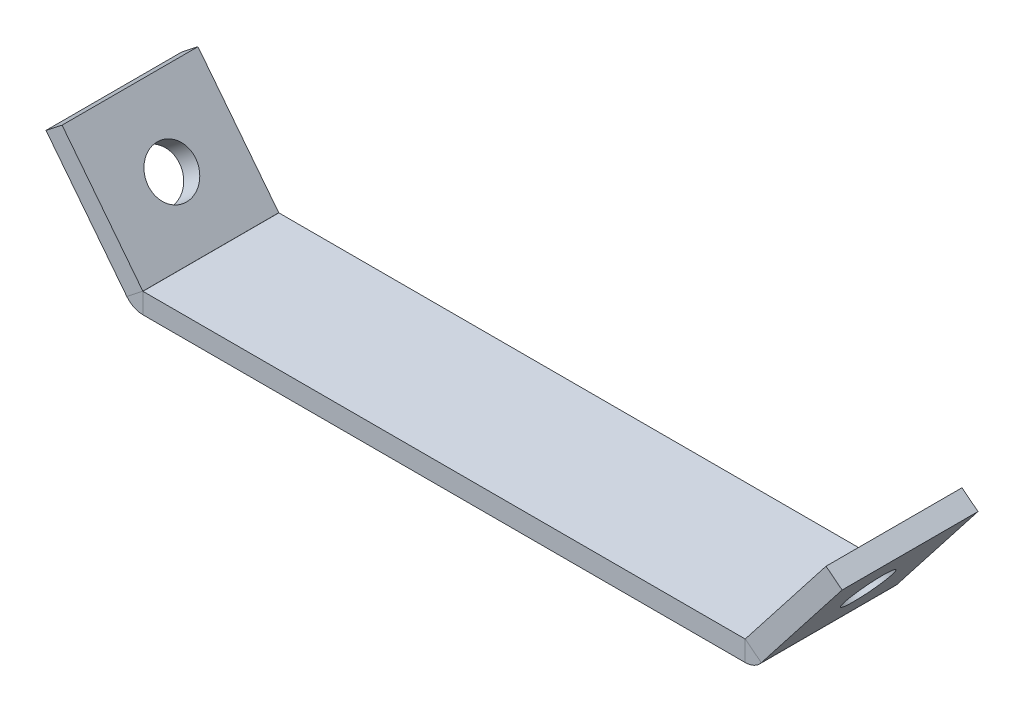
ISO-10303-21;
HEADER;
FILE_DESCRIPTION(('STEP AP214'),'2;1');
FILE_NAME('part.step','',(''),(''),'','','');
FILE_SCHEMA(('AUTOMOTIVE_DESIGN { 1 0 10303 214 1 1 1 1 }'));
ENDSEC;
DATA;
#1=APPLICATION_CONTEXT('core data for automotive mechanical design processes');
#2=APPLICATION_PROTOCOL_DEFINITION('international standard','automotive_design',2000,#1);
#3=PRODUCT_CONTEXT('',#1,'mechanical');
#4=PRODUCT('Part','Part','',(#3));
#5=PRODUCT_RELATED_PRODUCT_CATEGORY('part','',(#4));
#6=PRODUCT_DEFINITION_FORMATION('','',#4);
#7=PRODUCT_DEFINITION_CONTEXT('part definition',#1,'design');
#8=PRODUCT_DEFINITION('design','',#6,#7);
#9=PRODUCT_DEFINITION_SHAPE('','',#8);
#10=(LENGTH_UNIT() NAMED_UNIT(*) SI_UNIT(.MILLI.,.METRE.));
#11=(NAMED_UNIT(*) PLANE_ANGLE_UNIT() SI_UNIT($,.RADIAN.));
#12=(NAMED_UNIT(*) SI_UNIT($,.STERADIAN.) SOLID_ANGLE_UNIT());
#13=UNCERTAINTY_MEASURE_WITH_UNIT(LENGTH_MEASURE(1.E-05),#10,'distance_accuracy_value','');
#14=(GEOMETRIC_REPRESENTATION_CONTEXT(3) GLOBAL_UNCERTAINTY_ASSIGNED_CONTEXT((#13)) GLOBAL_UNIT_ASSIGNED_CONTEXT((#10,
#11,#12)) REPRESENTATION_CONTEXT('',''));
#15=CARTESIAN_POINT('',(0.,0.,0.));
#16=DIRECTION('',(0.,0.,1.));
#17=DIRECTION('',(1.,0.,0.));
#18=AXIS2_PLACEMENT_3D('',#15,#16,#17);
#19=CARTESIAN_POINT('',(0.,1.5,-10.));
#20=DIRECTION('',(0.,0.,1.));
#21=DIRECTION('',(1.,0.,0.));
#22=AXIS2_PLACEMENT_3D('',#19,#20,#21);
#23=PLANE('',#22);
#24=DIRECTION('',(-1.,0.,0.));
#25=VECTOR('',#24,1.);
#26=CARTESIAN_POINT('',(0.,1.5,-10.));
#27=LINE('',#26,#25);
#28=CARTESIAN_POINT('',(54.6551229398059,1.49999996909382,-10.));
#29=VERTEX_POINT('',#28);
#30=CARTESIAN_POINT('',(10.3448770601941,1.5,-10.));
#31=VERTEX_POINT('',#30);
#32=EDGE_CURVE('E236',#29,#31,#27,.T.);
#33=ORIENTED_EDGE('',*,*,#32,.F.);
#34=DIRECTION('',(0.,-1.,0.));
#35=VECTOR('',#34,1.);
#36=CARTESIAN_POINT('',(54.6551229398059,1.5,-10.));
#37=LINE('',#36,#35);
#38=CARTESIAN_POINT('',(54.6551229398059,0.,-10.));
#39=VERTEX_POINT('',#38);
#40=EDGE_CURVE('E12',#29,#39,#37,.T.);
#41=ORIENTED_EDGE('',*,*,#40,.T.);
#42=DIRECTION('',(-1.,0.,0.));
#43=VECTOR('',#42,1.);
#44=CARTESIAN_POINT('',(0.,0.,-10.));
#45=LINE('',#44,#43);
#46=CARTESIAN_POINT('',(10.3448770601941,0.,-10.));
#47=VERTEX_POINT('',#46);
#48=EDGE_CURVE('E251',#39,#47,#45,.T.);
#49=ORIENTED_EDGE('',*,*,#48,.T.);
#50=DIRECTION('',(0.,-1.,0.));
#51=VECTOR('',#50,1.);
#52=CARTESIAN_POINT('',(10.3448770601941,1.5,-10.));
#53=LINE('',#52,#51);
#54=EDGE_CURVE('E235',#31,#47,#53,.T.);
#55=ORIENTED_EDGE('',*,*,#54,.F.);
#56=EDGE_LOOP('',(#33,#41,#49,#55));
#57=FACE_BOUND('',#56,.T.);
#58=ADVANCED_FACE('F40',(#57),#23,.F.);
#59=CARTESIAN_POINT('',(0.,1.5,0.));
#60=DIRECTION('',(0.,0.,-1.));
#61=DIRECTION('',(-1.,0.,0.));
#62=AXIS2_PLACEMENT_3D('',#59,#60,#61);
#63=PLANE('',#62);
#64=DIRECTION('',(1.,0.,0.));
#65=VECTOR('',#64,1.);
#66=CARTESIAN_POINT('',(0.,0.,0.));
#67=LINE('',#66,#65);
#68=CARTESIAN_POINT('',(10.3448770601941,0.,0.));
#69=VERTEX_POINT('',#68);
#70=CARTESIAN_POINT('',(54.6551229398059,-3.82582060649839E-08,0.));
#71=VERTEX_POINT('',#70);
#72=EDGE_CURVE('E62',#69,#71,#67,.T.);
#73=ORIENTED_EDGE('',*,*,#72,.T.);
#74=DIRECTION('',(0.,1.,0.));
#75=VECTOR('',#74,1.);
#76=CARTESIAN_POINT('',(54.6551229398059,1.5,0.));
#77=LINE('',#76,#75);
#78=CARTESIAN_POINT('',(54.6551229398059,1.49999996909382,0.));
#79=VERTEX_POINT('',#78);
#80=EDGE_CURVE('E247',#71,#79,#77,.T.);
#81=ORIENTED_EDGE('',*,*,#80,.T.);
#82=DIRECTION('',(1.,0.,0.));
#83=VECTOR('',#82,1.);
#84=CARTESIAN_POINT('',(0.,1.5,0.));
#85=LINE('',#84,#83);
#86=CARTESIAN_POINT('',(10.3448770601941,1.50000000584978,0.));
#87=VERTEX_POINT('',#86);
#88=EDGE_CURVE('E43',#87,#79,#85,.T.);
#89=ORIENTED_EDGE('',*,*,#88,.F.);
#90=DIRECTION('',(0.,1.,0.));
#91=VECTOR('',#90,1.);
#92=CARTESIAN_POINT('',(10.3448770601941,1.5,0.));
#93=LINE('',#92,#91);
#94=EDGE_CURVE('E241',#69,#87,#93,.T.);
#95=ORIENTED_EDGE('',*,*,#94,.F.);
#96=EDGE_LOOP('',(#73,#81,#89,#95));
#97=FACE_BOUND('',#96,.T.);
#98=ADVANCED_FACE('F261',(#97),#63,.F.);
#99=CARTESIAN_POINT('',(0.,1.5,-10.));
#100=DIRECTION('',(0.,-1.,0.));
#101=DIRECTION('',(0.,0.,-1.));
#102=AXIS2_PLACEMENT_3D('',#99,#100,#101);
#103=PLANE('',#102);
#104=ORIENTED_EDGE('',*,*,#88,.T.);
#105=DIRECTION('',(0.,0.,-1.));
#106=VECTOR('',#105,1.);
#107=CARTESIAN_POINT('',(54.6551229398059,1.5,-10.));
#108=LINE('',#107,#106);
#109=EDGE_CURVE('E244',#79,#29,#108,.T.);
#110=ORIENTED_EDGE('',*,*,#109,.T.);
#111=ORIENTED_EDGE('',*,*,#32,.T.);
#112=DIRECTION('',(0.,0.,-1.));
#113=VECTOR('',#112,1.);
#114=CARTESIAN_POINT('',(10.3448770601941,1.5,-10.));
#115=LINE('',#114,#113);
#116=EDGE_CURVE('E232',#87,#31,#115,.T.);
#117=ORIENTED_EDGE('',*,*,#116,.F.);
#118=EDGE_LOOP('',(#104,#110,#111,#117));
#119=FACE_BOUND('',#118,.T.);
#120=ADVANCED_FACE('F258',(#119),#103,.F.);
#121=CARTESIAN_POINT('',(0.,0.,-10.));
#122=DIRECTION('',(0.,-1.,0.));
#123=DIRECTION('',(0.,0.,-1.));
#124=AXIS2_PLACEMENT_3D('',#121,#122,#123);
#125=PLANE('',#124);
#126=DIRECTION('',(0.,0.,-1.));
#127=VECTOR('',#126,1.);
#128=CARTESIAN_POINT('',(54.6551229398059,0.,-10.));
#129=LINE('',#128,#127);
#130=EDGE_CURVE('E48',#71,#39,#129,.T.);
#131=ORIENTED_EDGE('',*,*,#130,.F.);
#132=ORIENTED_EDGE('',*,*,#72,.F.);
#133=DIRECTION('',(0.,0.,-1.));
#134=VECTOR('',#133,1.);
#135=CARTESIAN_POINT('',(10.3448770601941,0.,-10.));
#136=LINE('',#135,#134);
#137=EDGE_CURVE('E239',#69,#47,#136,.T.);
#138=ORIENTED_EDGE('',*,*,#137,.T.);
#139=ORIENTED_EDGE('',*,*,#48,.F.);
#140=EDGE_LOOP('',(#131,#132,#138,#139));
#141=FACE_BOUND('',#140,.T.);
#142=ADVANCED_FACE('F311',(#141),#125,.T.);
#143=CARTESIAN_POINT('',(10.3448770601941,1.50999999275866,0.));
#144=DIRECTION('',(0.,0.,-1.));
#145=DIRECTION('',(-1.,0.,0.));
#146=AXIS2_PLACEMENT_3D('',#143,#144,#145);
#147=PLANE('',#146);
#148=DIRECTION('',(0.788010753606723,0.615661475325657,0.));
#149=VECTOR('',#148,1.);
#150=CARTESIAN_POINT('',(10.336996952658,1.50384338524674,0.));
#151=LINE('',#150,#149);
#152=CARTESIAN_POINT('',(9.15498082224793,0.580351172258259,0.));
#153=VERTEX_POINT('',#152);
#154=CARTESIAN_POINT('',(10.336996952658,1.50384338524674,0.));
#155=VERTEX_POINT('',#154);
#156=EDGE_CURVE('E187',#153,#155,#151,.T.);
#157=ORIENTED_EDGE('',*,*,#156,.F.);
#158=CARTESIAN_POINT('',(10.3448770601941,1.51,0.));
#159=DIRECTION('',(0.,0.,1.));
#160=DIRECTION('',(1.,0.,0.));
#161=AXIS2_PLACEMENT_3D('',#158,#159,#160);
#162=CIRCLE('',#161,1.50999999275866);
#163=EDGE_CURVE('E186',#153,#69,#162,.T.);
#164=ORIENTED_EDGE('',*,*,#163,.T.);
#165=ORIENTED_EDGE('',*,*,#94,.T.);
#166=CARTESIAN_POINT('',(10.3448770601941,1.50999999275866,0.));
#167=DIRECTION('',(0.,0.,1.));
#168=DIRECTION('',(1.,0.,0.));
#169=AXIS2_PLACEMENT_3D('',#166,#167,#168);
#170=CIRCLE('',#169,0.00999998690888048);
#171=EDGE_CURVE('E224',#155,#87,#170,.T.);
#172=ORIENTED_EDGE('',*,*,#171,.F.);
#173=EDGE_LOOP('',(#157,#164,#165,#172));
#174=FACE_BOUND('',#173,.T.);
#175=ADVANCED_FACE('F307',(#174),#147,.F.);
#176=CARTESIAN_POINT('',(10.3448770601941,1.50999999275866,-10.));
#177=DIRECTION('',(0.,0.,1.));
#178=DIRECTION('',(1.,0.,0.));
#179=AXIS2_PLACEMENT_3D('',#176,#177,#178);
#180=PLANE('',#179);
#181=ORIENTED_EDGE('',*,*,#54,.T.);
#182=CARTESIAN_POINT('',(10.3448770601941,1.51,-10.));
#183=DIRECTION('',(0.,0.,1.));
#184=DIRECTION('',(1.,0.,0.));
#185=AXIS2_PLACEMENT_3D('',#182,#183,#184);
#186=CIRCLE('',#185,1.50999999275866);
#187=CARTESIAN_POINT('',(9.15498082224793,0.580351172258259,-10.));
#188=VERTEX_POINT('',#187);
#189=EDGE_CURVE('E221',#47,#188,#186,.F.);
#190=ORIENTED_EDGE('',*,*,#189,.T.);
#191=DIRECTION('',(-0.788010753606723,-0.615661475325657,0.));
#192=VECTOR('',#191,1.);
#193=CARTESIAN_POINT('',(10.336996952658,1.50384338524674,-10.));
#194=LINE('',#193,#192);
#195=CARTESIAN_POINT('',(10.3369969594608,1.50384339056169,-10.));
#196=VERTEX_POINT('',#195);
#197=EDGE_CURVE('E197',#196,#188,#194,.T.);
#198=ORIENTED_EDGE('',*,*,#197,.F.);
#199=CARTESIAN_POINT('',(10.3448770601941,1.50999999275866,-10.));
#200=DIRECTION('',(0.,0.,-1.));
#201=DIRECTION('',(-1.,0.,0.));
#202=AXIS2_PLACEMENT_3D('',#199,#200,#201);
#203=CIRCLE('',#202,0.00999998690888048);
#204=EDGE_CURVE('E229',#31,#196,#203,.T.);
#205=ORIENTED_EDGE('',*,*,#204,.F.);
#206=EDGE_LOOP('',(#181,#190,#198,#205));
#207=FACE_BOUND('',#206,.T.);
#208=ADVANCED_FACE('F293',(#207),#180,.F.);
#209=CARTESIAN_POINT('',(10.3448770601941,1.51,-15.1353717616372));
#210=DIRECTION('',(0.,0.,1.));
#211=DIRECTION('',(1.,0.,0.));
#212=AXIS2_PLACEMENT_3D('',#209,#210,#211);
#213=CYLINDRICAL_SURFACE('',#212,0.00999999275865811);
#214=ORIENTED_EDGE('',*,*,#204,.T.);
#215=DIRECTION('',(0.,0.,-1.));
#216=VECTOR('',#215,1.);
#217=CARTESIAN_POINT('',(10.336996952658,1.50384338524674,-10.));
#218=LINE('',#217,#216);
#219=EDGE_CURVE('E205',#155,#196,#218,.T.);
#220=ORIENTED_EDGE('',*,*,#219,.F.);
#221=ORIENTED_EDGE('',*,*,#171,.T.);
#222=ORIENTED_EDGE('',*,*,#116,.T.);
#223=EDGE_LOOP('',(#214,#220,#221,#222));
#224=FACE_BOUND('',#223,.T.);
#225=ADVANCED_FACE('F289',(#224),#213,.F.);
#226=CARTESIAN_POINT('',(10.3448770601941,1.51,-15.1353717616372));
#227=DIRECTION('',(0.,0.,1.));
#228=DIRECTION('',(1.,0.,0.));
#229=AXIS2_PLACEMENT_3D('',#226,#227,#228);
#230=CYLINDRICAL_SURFACE('',#229,1.50999999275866);
#231=ORIENTED_EDGE('',*,*,#189,.F.);
#232=ORIENTED_EDGE('',*,*,#137,.F.);
#233=ORIENTED_EDGE('',*,*,#163,.F.);
#234=DIRECTION('',(0.,0.,-1.));
#235=VECTOR('',#234,1.);
#236=CARTESIAN_POINT('',(9.15498082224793,0.580351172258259,-10.));
#237=LINE('',#236,#235);
#238=EDGE_CURVE('E182',#153,#188,#237,.T.);
#239=ORIENTED_EDGE('',*,*,#238,.T.);
#240=EDGE_LOOP('',(#231,#232,#233,#239));
#241=FACE_BOUND('',#240,.T.);
#242=ADVANCED_FACE('F310',(#241),#230,.T.);
#243=CARTESIAN_POINT('',(4.39270971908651,9.11218408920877,0.));
#244=DIRECTION('',(0.615661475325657,-0.788010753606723,0.));
#245=DIRECTION('',(0.,0.,-1.));
#246=AXIS2_PLACEMENT_3D('',#243,#244,#245);
#247=PLANE('',#246);
#248=DIRECTION('',(0.,0.,1.));
#249=VECTOR('',#248,1.);
#250=CARTESIAN_POINT('',(3.21069358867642,8.18869187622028,0.));
#251=LINE('',#250,#249);
#252=CARTESIAN_POINT('',(3.21069358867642,8.18869187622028,-10.));
#253=VERTEX_POINT('',#252);
#254=CARTESIAN_POINT('',(3.21069358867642,8.18869187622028,0.));
#255=VERTEX_POINT('',#254);
#256=EDGE_CURVE('E216',#253,#255,#251,.T.);
#257=ORIENTED_EDGE('',*,*,#256,.T.);
#258=DIRECTION('',(-0.788010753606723,-0.615661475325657,0.));
#259=VECTOR('',#258,1.);
#260=CARTESIAN_POINT('',(4.39270971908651,9.11218408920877,0.));
#261=LINE('',#260,#259);
#262=CARTESIAN_POINT('',(4.39270971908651,9.11218408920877,0.));
#263=VERTEX_POINT('',#262);
#264=EDGE_CURVE('E183',#263,#255,#261,.T.);
#265=ORIENTED_EDGE('',*,*,#264,.F.);
#266=DIRECTION('',(0.,0.,1.));
#267=VECTOR('',#266,1.);
#268=CARTESIAN_POINT('',(4.39270971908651,9.11218408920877,0.));
#269=LINE('',#268,#267);
#270=CARTESIAN_POINT('',(4.39270971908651,9.11218408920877,-10.));
#271=VERTEX_POINT('',#270);
#272=EDGE_CURVE('E200',#271,#263,#269,.T.);
#273=ORIENTED_EDGE('',*,*,#272,.F.);
#274=DIRECTION('',(-0.788010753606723,-0.615661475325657,0.));
#275=VECTOR('',#274,1.);
#276=CARTESIAN_POINT('',(4.39270971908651,9.11218408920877,-10.));
#277=LINE('',#276,#275);
#278=EDGE_CURVE('E213',#271,#253,#277,.T.);
#279=ORIENTED_EDGE('',*,*,#278,.T.);
#280=EDGE_LOOP('',(#257,#265,#273,#279));
#281=FACE_BOUND('',#280,.T.);
#282=ADVANCED_FACE('F333',(#281),#247,.F.);
#283=CARTESIAN_POINT('',(7.47101709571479,5.17213032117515,-5.));
#284=DIRECTION('',(-0.788010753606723,-0.615661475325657,0.));
#285=DIRECTION('',(0.,0.,-1.));
#286=AXIS2_PLACEMENT_3D('',#283,#284,#285);
#287=CYLINDRICAL_SURFACE('',#286,1.75);
#288=CARTESIAN_POINT('',(7.47101709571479,5.17213032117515,-5.));
#289=DIRECTION('',(0.788010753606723,0.615661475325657,0.));
#290=DIRECTION('',(0.,0.,1.));
#291=AXIS2_PLACEMENT_3D('',#288,#289,#290);
#292=CIRCLE('',#291,1.75);
#293=CARTESIAN_POINT('',(7.47101709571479,5.17213032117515,-3.25));
#294=VERTEX_POINT('',#293);
#295=EDGE_CURVE('E210',#294,#294,#292,.T.);
#296=ORIENTED_EDGE('',*,*,#295,.T.);
#297=EDGE_LOOP('',(#296));
#298=FACE_BOUND('',#297,.T.);
#299=CARTESIAN_POINT('',(6.28900096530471,4.24863810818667,-5.));
#300=DIRECTION('',(0.788010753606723,0.615661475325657,0.));
#301=DIRECTION('',(0.,0.,1.));
#302=AXIS2_PLACEMENT_3D('',#299,#300,#301);
#303=CIRCLE('',#302,1.75);
#304=CARTESIAN_POINT('',(6.28900096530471,4.24863810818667,-3.25));
#305=VERTEX_POINT('',#304);
#306=EDGE_CURVE('E192',#305,#305,#303,.T.);
#307=ORIENTED_EDGE('',*,*,#306,.F.);
#308=EDGE_LOOP('',(#307));
#309=FACE_BOUND('',#308,.T.);
#310=ADVANCED_FACE('F344',(#298,#309),#287,.F.);
#311=CARTESIAN_POINT('',(4.39270971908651,9.11218408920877,-10.));
#312=DIRECTION('',(-0.788010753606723,-0.615661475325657,0.));
#313=DIRECTION('',(0.,0.,-1.));
#314=AXIS2_PLACEMENT_3D('',#311,#312,#313);
#315=PLANE('',#314);
#316=ORIENTED_EDGE('',*,*,#295,.F.);
#317=EDGE_LOOP('',(#316));
#318=FACE_BOUND('',#317,.T.);
#319=DIRECTION('',(0.615661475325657,-0.788010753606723,0.));
#320=VECTOR('',#319,1.);
#321=CARTESIAN_POINT('',(4.39270971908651,9.11218408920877,0.));
#322=LINE('',#321,#320);
#323=EDGE_CURVE('E208',#263,#155,#322,.T.);
#324=ORIENTED_EDGE('',*,*,#323,.T.);
#325=ORIENTED_EDGE('',*,*,#219,.T.);
#326=DIRECTION('',(-0.615661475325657,0.788010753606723,0.));
#327=VECTOR('',#326,1.);
#328=CARTESIAN_POINT('',(4.39270971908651,9.11218408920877,-10.));
#329=LINE('',#328,#327);
#330=EDGE_CURVE('E203',#196,#271,#329,.T.);
#331=ORIENTED_EDGE('',*,*,#330,.T.);
#332=ORIENTED_EDGE('',*,*,#272,.T.);
#333=EDGE_LOOP('',(#324,#325,#331,#332));
#334=FACE_BOUND('',#333,.T.);
#335=ADVANCED_FACE('F299',(#318,#334),#315,.F.);
#336=CARTESIAN_POINT('',(4.39270971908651,9.11218408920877,-10.));
#337=DIRECTION('',(0.,0.,1.));
#338=DIRECTION('',(0.615661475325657,-0.788010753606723,0.));
#339=AXIS2_PLACEMENT_3D('',#336,#337,#338);
#340=PLANE('',#339);
#341=ORIENTED_EDGE('',*,*,#330,.F.);
#342=ORIENTED_EDGE('',*,*,#197,.T.);
#343=DIRECTION('',(-0.615661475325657,0.788010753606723,0.));
#344=VECTOR('',#343,1.);
#345=CARTESIAN_POINT('',(3.21069358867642,8.18869187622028,-10.));
#346=LINE('',#345,#344);
#347=EDGE_CURVE('E195',#188,#253,#346,.T.);
#348=ORIENTED_EDGE('',*,*,#347,.T.);
#349=ORIENTED_EDGE('',*,*,#278,.F.);
#350=EDGE_LOOP('',(#341,#342,#348,#349));
#351=FACE_BOUND('',#350,.T.);
#352=ADVANCED_FACE('F295',(#351),#340,.F.);
#353=CARTESIAN_POINT('',(3.21069358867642,8.18869187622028,-10.));
#354=DIRECTION('',(-0.788010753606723,-0.615661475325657,0.));
#355=DIRECTION('',(0.,0.,-1.));
#356=AXIS2_PLACEMENT_3D('',#353,#354,#355);
#357=PLANE('',#356);
#358=ORIENTED_EDGE('',*,*,#238,.F.);
#359=DIRECTION('',(0.615661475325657,-0.788010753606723,0.));
#360=VECTOR('',#359,1.);
#361=CARTESIAN_POINT('',(3.21069358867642,8.18869187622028,0.));
#362=LINE('',#361,#360);
#363=EDGE_CURVE('E190',#255,#153,#362,.T.);
#364=ORIENTED_EDGE('',*,*,#363,.F.);
#365=ORIENTED_EDGE('',*,*,#256,.F.);
#366=ORIENTED_EDGE('',*,*,#347,.F.);
#367=EDGE_LOOP('',(#358,#364,#365,#366));
#368=FACE_BOUND('',#367,.T.);
#369=ORIENTED_EDGE('',*,*,#306,.T.);
#370=EDGE_LOOP('',(#369));
#371=FACE_BOUND('',#370,.T.);
#372=ADVANCED_FACE('F336',(#368,#371),#357,.T.);
#373=CARTESIAN_POINT('',(4.39270971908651,9.11218408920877,0.));
#374=DIRECTION('',(0.,0.,-1.));
#375=DIRECTION('',(-0.615661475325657,0.788010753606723,0.));
#376=AXIS2_PLACEMENT_3D('',#373,#374,#375);
#377=PLANE('',#376);
#378=ORIENTED_EDGE('',*,*,#363,.T.);
#379=ORIENTED_EDGE('',*,*,#156,.T.);
#380=ORIENTED_EDGE('',*,*,#323,.F.);
#381=ORIENTED_EDGE('',*,*,#264,.T.);
#382=EDGE_LOOP('',(#378,#379,#380,#381));
#383=FACE_BOUND('',#382,.T.);
#384=ADVANCED_FACE('F303',(#383),#377,.F.);
#385=CARTESIAN_POINT('',(54.6551229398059,1.51000003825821,0.));
#386=DIRECTION('',(0.,0.,-1.));
#387=DIRECTION('',(-1.,0.,0.));
#388=AXIS2_PLACEMENT_3D('',#385,#386,#387);
#389=PLANE('',#388);
#390=ORIENTED_EDGE('',*,*,#80,.F.);
#391=CARTESIAN_POINT('',(54.6551229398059,1.51,0.));
#392=DIRECTION('',(0.,0.,-1.));
#393=DIRECTION('',(-1.,0.,0.));
#394=AXIS2_PLACEMENT_3D('',#391,#392,#393);
#395=CIRCLE('',#394,1.51000003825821);
#396=CARTESIAN_POINT('',(55.8450191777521,0.580351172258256,0.));
#397=VERTEX_POINT('',#396);
#398=EDGE_CURVE('E174',#71,#397,#395,.F.);
#399=ORIENTED_EDGE('',*,*,#398,.T.);
#400=DIRECTION('',(-0.788010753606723,0.615661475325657,0.));
#401=VECTOR('',#400,1.);
#402=CARTESIAN_POINT('',(54.663003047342,1.50384338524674,0.));
#403=LINE('',#402,#401);
#404=CARTESIAN_POINT('',(54.663003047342,1.50384338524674,0.));
#405=VERTEX_POINT('',#404);
#406=EDGE_CURVE('E139',#397,#405,#403,.T.);
#407=ORIENTED_EDGE('',*,*,#406,.T.);
#408=CARTESIAN_POINT('',(54.6551229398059,1.51000003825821,0.));
#409=DIRECTION('',(0.,0.,1.));
#410=DIRECTION('',(1.,0.,0.));
#411=AXIS2_PLACEMENT_3D('',#408,#409,#410);
#412=CIRCLE('',#411,0.0100000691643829);
#413=EDGE_CURVE('E173',#79,#405,#412,.T.);
#414=ORIENTED_EDGE('',*,*,#413,.F.);
#415=EDGE_LOOP('',(#390,#399,#407,#414));
#416=FACE_BOUND('',#415,.T.);
#417=ADVANCED_FACE('F263',(#416),#389,.F.);
#418=CARTESIAN_POINT('',(54.6551229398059,1.51000003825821,-10.));
#419=DIRECTION('',(0.,0.,1.));
#420=DIRECTION('',(1.,0.,0.));
#421=AXIS2_PLACEMENT_3D('',#418,#419,#420);
#422=PLANE('',#421);
#423=DIRECTION('',(0.788010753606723,-0.615661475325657,0.));
#424=VECTOR('',#423,1.);
#425=CARTESIAN_POINT('',(54.663003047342,1.50384338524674,-10.));
#426=LINE('',#425,#424);
#427=CARTESIAN_POINT('',(54.6630030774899,1.50384336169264,-10.));
#428=VERTEX_POINT('',#427);
#429=CARTESIAN_POINT('',(55.8450191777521,0.580351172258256,-10.));
#430=VERTEX_POINT('',#429);
#431=EDGE_CURVE('E165',#428,#430,#426,.T.);
#432=ORIENTED_EDGE('',*,*,#431,.T.);
#433=CARTESIAN_POINT('',(54.6551229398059,1.51,-10.));
#434=DIRECTION('',(0.,0.,-1.));
#435=DIRECTION('',(-1.,0.,0.));
#436=AXIS2_PLACEMENT_3D('',#433,#434,#435);
#437=CIRCLE('',#436,1.51000003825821);
#438=EDGE_CURVE('E171',#430,#39,#437,.T.);
#439=ORIENTED_EDGE('',*,*,#438,.T.);
#440=ORIENTED_EDGE('',*,*,#40,.F.);
#441=CARTESIAN_POINT('',(54.6551229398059,1.51000003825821,-10.));
#442=DIRECTION('',(0.,0.,-1.));
#443=DIRECTION('',(-1.,0.,0.));
#444=AXIS2_PLACEMENT_3D('',#441,#442,#443);
#445=CIRCLE('',#444,0.0100000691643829);
#446=EDGE_CURVE('E179',#428,#29,#445,.T.);
#447=ORIENTED_EDGE('',*,*,#446,.F.);
#448=EDGE_LOOP('',(#432,#439,#440,#447));
#449=FACE_BOUND('',#448,.T.);
#450=ADVANCED_FACE('F282',(#449),#422,.F.);
#451=CARTESIAN_POINT('',(54.6551229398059,1.51,5.13537176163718));
#452=DIRECTION('',(0.,0.,-1.));
#453=DIRECTION('',(-1.,0.,0.));
#454=AXIS2_PLACEMENT_3D('',#451,#452,#453);
#455=CYLINDRICAL_SURFACE('',#454,0.010000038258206);
#456=ORIENTED_EDGE('',*,*,#446,.T.);
#457=ORIENTED_EDGE('',*,*,#109,.F.);
#458=ORIENTED_EDGE('',*,*,#413,.T.);
#459=DIRECTION('',(0.,0.,-1.));
#460=VECTOR('',#459,1.);
#461=CARTESIAN_POINT('',(54.663003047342,1.50384338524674,-10.));
#462=LINE('',#461,#460);
#463=EDGE_CURVE('E168',#405,#428,#462,.T.);
#464=ORIENTED_EDGE('',*,*,#463,.T.);
#465=EDGE_LOOP('',(#456,#457,#458,#464));
#466=FACE_BOUND('',#465,.T.);
#467=ADVANCED_FACE('F279',(#466),#455,.F.);
#468=CARTESIAN_POINT('',(54.6551229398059,1.51,5.13537176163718));
#469=DIRECTION('',(0.,0.,-1.));
#470=DIRECTION('',(-1.,0.,0.));
#471=AXIS2_PLACEMENT_3D('',#468,#469,#470);
#472=CYLINDRICAL_SURFACE('',#471,1.51000003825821);
#473=ORIENTED_EDGE('',*,*,#438,.F.);
#474=DIRECTION('',(0.,0.,-1.));
#475=VECTOR('',#474,1.);
#476=CARTESIAN_POINT('',(55.8450191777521,0.580351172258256,-10.));
#477=LINE('',#476,#475);
#478=EDGE_CURVE('E265',#397,#430,#477,.T.);
#479=ORIENTED_EDGE('',*,*,#478,.F.);
#480=ORIENTED_EDGE('',*,*,#398,.F.);
#481=ORIENTED_EDGE('',*,*,#130,.T.);
#482=EDGE_LOOP('',(#473,#479,#480,#481));
#483=FACE_BOUND('',#482,.T.);
#484=ADVANCED_FACE('F264',(#483),#472,.T.);
#485=CARTESIAN_POINT('',(57.5289829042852,5.17213032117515,-5.));
#486=DIRECTION('',(0.788010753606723,-0.615661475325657,0.));
#487=DIRECTION('',(0.,0.,-1.));
#488=AXIS2_PLACEMENT_3D('',#485,#486,#487);
#489=CYLINDRICAL_SURFACE('',#488,1.75);
#490=CARTESIAN_POINT('',(57.5289829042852,5.17213032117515,-5.));
#491=DIRECTION('',(-0.788010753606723,0.615661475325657,0.));
#492=DIRECTION('',(0.,0.,1.));
#493=AXIS2_PLACEMENT_3D('',#490,#491,#492);
#494=CIRCLE('',#493,1.75);
#495=CARTESIAN_POINT('',(57.5289829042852,5.17213032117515,-3.25));
#496=VERTEX_POINT('',#495);
#497=EDGE_CURVE('E158',#496,#496,#494,.T.);
#498=ORIENTED_EDGE('',*,*,#497,.T.);
#499=EDGE_LOOP('',(#498));
#500=FACE_BOUND('',#499,.T.);
#501=CARTESIAN_POINT('',(58.7109990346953,4.24863810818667,-5.));
#502=DIRECTION('',(-0.788010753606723,0.615661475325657,0.));
#503=DIRECTION('',(0.,0.,1.));
#504=AXIS2_PLACEMENT_3D('',#501,#502,#503);
#505=CIRCLE('',#504,1.75);
#506=CARTESIAN_POINT('',(58.7109990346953,4.24863810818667,-3.25));
#507=VERTEX_POINT('',#506);
#508=EDGE_CURVE('E144',#507,#507,#505,.T.);
#509=ORIENTED_EDGE('',*,*,#508,.F.);
#510=EDGE_LOOP('',(#509));
#511=FACE_BOUND('',#510,.T.);
#512=ADVANCED_FACE('F360',(#500,#511),#489,.F.);
#513=CARTESIAN_POINT('',(60.6072902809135,9.11218408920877,0.));
#514=DIRECTION('',(-0.615661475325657,-0.788010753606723,0.));
#515=DIRECTION('',(0.,0.,1.));
#516=AXIS2_PLACEMENT_3D('',#513,#514,#515);
#517=PLANE('',#516);
#518=DIRECTION('',(0.,0.,-1.));
#519=VECTOR('',#518,1.);
#520=CARTESIAN_POINT('',(61.7893064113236,8.18869187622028,0.));
#521=LINE('',#520,#519);
#522=CARTESIAN_POINT('',(61.7893064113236,8.18869187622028,0.));
#523=VERTEX_POINT('',#522);
#524=CARTESIAN_POINT('',(61.7893064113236,8.18869187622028,-10.));
#525=VERTEX_POINT('',#524);
#526=EDGE_CURVE('E150',#523,#525,#521,.T.);
#527=ORIENTED_EDGE('',*,*,#526,.T.);
#528=DIRECTION('',(0.788010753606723,-0.615661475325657,0.));
#529=VECTOR('',#528,1.);
#530=CARTESIAN_POINT('',(60.6072902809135,9.11218408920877,-10.));
#531=LINE('',#530,#529);
#532=CARTESIAN_POINT('',(60.6072902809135,9.11218408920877,-10.));
#533=VERTEX_POINT('',#532);
#534=EDGE_CURVE('E266',#533,#525,#531,.T.);
#535=ORIENTED_EDGE('',*,*,#534,.F.);
#536=DIRECTION('',(0.,0.,-1.));
#537=VECTOR('',#536,1.);
#538=CARTESIAN_POINT('',(60.6072902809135,9.11218408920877,0.));
#539=LINE('',#538,#537);
#540=CARTESIAN_POINT('',(60.6072902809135,9.11218408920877,0.));
#541=VERTEX_POINT('',#540);
#542=EDGE_CURVE('E152',#541,#533,#539,.T.);
#543=ORIENTED_EDGE('',*,*,#542,.F.);
#544=DIRECTION('',(0.788010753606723,-0.615661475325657,0.));
#545=VECTOR('',#544,1.);
#546=CARTESIAN_POINT('',(60.6072902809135,9.11218408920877,0.));
#547=LINE('',#546,#545);
#548=EDGE_CURVE('E136',#541,#523,#547,.T.);
#549=ORIENTED_EDGE('',*,*,#548,.T.);
#550=EDGE_LOOP('',(#527,#535,#543,#549));
#551=FACE_BOUND('',#550,.T.);
#552=ADVANCED_FACE('F148',(#551),#517,.F.);
#553=CARTESIAN_POINT('',(20.5892943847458,-42.1085148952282,-10.));
#554=DIRECTION('',(0.788010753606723,-0.615661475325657,0.));
#555=DIRECTION('',(0.,0.,-1.));
#556=AXIS2_PLACEMENT_3D('',#553,#554,#555);
#557=PLANE('',#556);
#558=ORIENTED_EDGE('',*,*,#463,.F.);
#559=DIRECTION('',(0.615661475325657,0.788010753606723,0.));
#560=VECTOR('',#559,1.);
#561=CARTESIAN_POINT('',(20.5892943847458,-42.1085148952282,0.));
#562=LINE('',#561,#560);
#563=EDGE_CURVE('E153',#405,#541,#562,.T.);
#564=ORIENTED_EDGE('',*,*,#563,.T.);
#565=ORIENTED_EDGE('',*,*,#542,.T.);
#566=DIRECTION('',(-0.615661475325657,-0.788010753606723,0.));
#567=VECTOR('',#566,1.);
#568=CARTESIAN_POINT('',(20.5892943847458,-42.1085148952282,-10.));
#569=LINE('',#568,#567);
#570=EDGE_CURVE('E145',#533,#428,#569,.T.);
#571=ORIENTED_EDGE('',*,*,#570,.T.);
#572=EDGE_LOOP('',(#558,#564,#565,#571));
#573=FACE_BOUND('',#572,.T.);
#574=ORIENTED_EDGE('',*,*,#497,.F.);
#575=EDGE_LOOP('',(#574));
#576=FACE_BOUND('',#575,.T.);
#577=ADVANCED_FACE('F276',(#573,#576),#557,.F.);
#578=CARTESIAN_POINT('',(20.5892943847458,-42.1085148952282,0.));
#579=DIRECTION('',(0.,0.,-1.));
#580=DIRECTION('',(-0.615661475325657,-0.788010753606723,0.));
#581=AXIS2_PLACEMENT_3D('',#578,#579,#580);
#582=PLANE('',#581);
#583=ORIENTED_EDGE('',*,*,#406,.F.);
#584=DIRECTION('',(0.615661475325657,0.788010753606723,0.));
#585=VECTOR('',#584,1.);
#586=CARTESIAN_POINT('',(21.7713105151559,-43.0320071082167,0.));
#587=LINE('',#586,#585);
#588=EDGE_CURVE('E132',#397,#523,#587,.T.);
#589=ORIENTED_EDGE('',*,*,#588,.T.);
#590=ORIENTED_EDGE('',*,*,#548,.F.);
#591=ORIENTED_EDGE('',*,*,#563,.F.);
#592=EDGE_LOOP('',(#583,#589,#590,#591));
#593=FACE_BOUND('',#592,.T.);
#594=ADVANCED_FACE('F134',(#593),#582,.F.);
#595=CARTESIAN_POINT('',(21.7713105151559,-43.0320071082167,-10.));
#596=DIRECTION('',(0.788010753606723,-0.615661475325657,0.));
#597=DIRECTION('',(0.,0.,-1.));
#598=AXIS2_PLACEMENT_3D('',#595,#596,#597);
#599=PLANE('',#598);
#600=ORIENTED_EDGE('',*,*,#508,.T.);
#601=EDGE_LOOP('',(#600));
#602=FACE_BOUND('',#601,.T.);
#603=ORIENTED_EDGE('',*,*,#588,.F.);
#604=ORIENTED_EDGE('',*,*,#478,.T.);
#605=DIRECTION('',(-0.615661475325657,-0.788010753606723,0.));
#606=VECTOR('',#605,1.);
#607=CARTESIAN_POINT('',(21.7713105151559,-43.0320071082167,-10.));
#608=LINE('',#607,#606);
#609=EDGE_CURVE('E157',#525,#430,#608,.T.);
#610=ORIENTED_EDGE('',*,*,#609,.F.);
#611=ORIENTED_EDGE('',*,*,#526,.F.);
#612=EDGE_LOOP('',(#603,#604,#610,#611));
#613=FACE_BOUND('',#612,.T.);
#614=ADVANCED_FACE('F156',(#602,#613),#599,.T.);
#615=CARTESIAN_POINT('',(20.5892943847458,-42.1085148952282,-10.));
#616=DIRECTION('',(0.,0.,1.));
#617=DIRECTION('',(0.615661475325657,0.788010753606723,0.));
#618=AXIS2_PLACEMENT_3D('',#615,#616,#617);
#619=PLANE('',#618);
#620=ORIENTED_EDGE('',*,*,#431,.F.);
#621=ORIENTED_EDGE('',*,*,#570,.F.);
#622=ORIENTED_EDGE('',*,*,#534,.T.);
#623=ORIENTED_EDGE('',*,*,#609,.T.);
#624=EDGE_LOOP('',(#620,#621,#622,#623));
#625=FACE_BOUND('',#624,.T.);
#626=ADVANCED_FACE('F361',(#625),#619,.F.);
#627=CLOSED_SHELL('',(#58,#98,#120,#142,#175,#208,#225,#242,#282,#310,#335,#352,#372,#384,#417,
#450,#467,#484,#512,#552,#577,#594,#614,#626));
#628=MANIFOLD_SOLID_BREP('B2',#627);
#629=ADVANCED_BREP_SHAPE_REPRESENTATION('',(#18,#628),#14);
#630=SHAPE_DEFINITION_REPRESENTATION(#9,#629);
ENDSEC;
END-ISO-10303-21;
